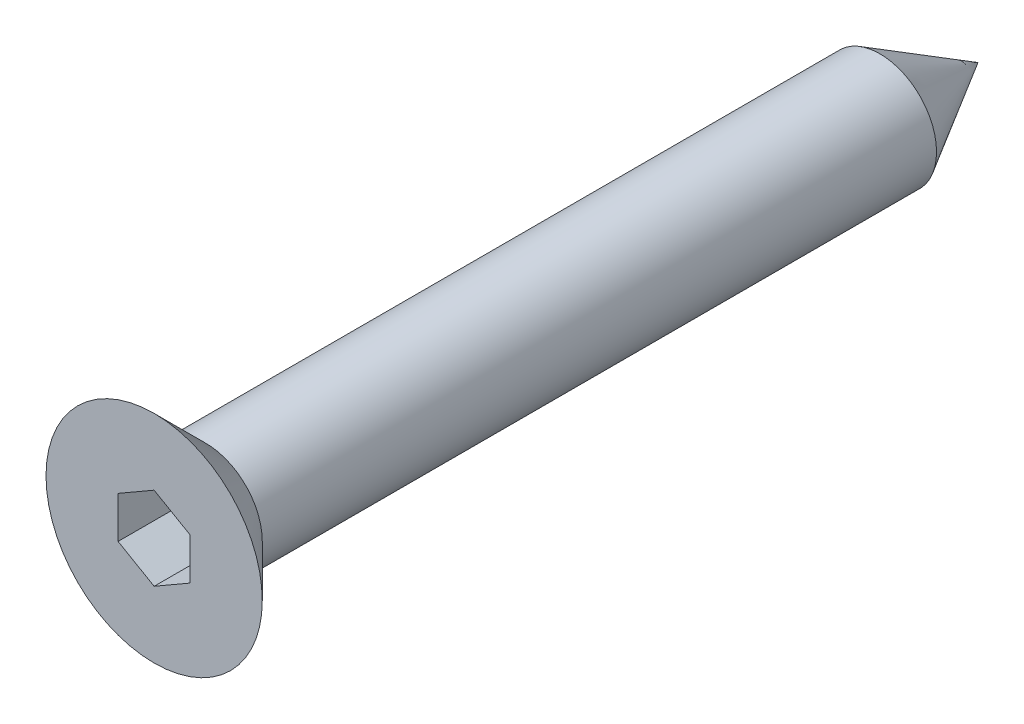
from build123d import *

# Parameters (mm, degrees)
ESQUISSE3_R             = 1.1
EXTRUSION1_DEPTH        = 16
ENL_V_MAT_EXTRU_2_DEPTH = 1.5
CHANFREIN1_SIZE         = 1.1
CHANFREIN1_SIZE2        = 1.905255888


with BuildPart() as part:
    # Esquisse1 → R_volution2 (revolve)
    with BuildSketch(Plane(origin=(0, 0, 0), x_dir=(0, 0, -1), z_dir=(1, 0, 0)), mode=Mode.PRIVATE) as r_volution2_sk:
        Polygon((0, 2.1), (1, 1.1), (1, 0), (0, 0), align=None)
    revolve(r_volution2_sk.sketch.rotate(Axis((0, 0, 1.603508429), (0, 0, -1)), 90), axis=Axis((0, 0, 1.603508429), (0, 0, -1)))

    # Esquisse3 → Extrusion1 (add)
    with BuildSketch(Plane.XY):
        Circle(ESQUISSE3_R)
    extrude(amount=-EXTRUSION1_DEPTH)

    # Esquisse2 → Enl_v. mat.-Extru.2 (cut)
    with BuildSketch(Plane.XY):
        Polygon((0, 0.808290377), (-0.7, 0.404145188), (-0.7, -0.404145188), (0, -0.808290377), (0.7, -0.404145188), (0.7, 0.404145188), align=None)
    extrude(amount=-ENL_V_MAT_EXTRU_2_DEPTH, mode=Mode.SUBTRACT)

    # Chanfrein1
    chanfrein1_edges = [part.edges().sort_by_distance(p)[0] for p in [
        (-1.1, 0, -16),
    ]]
    chanfrein1_side = [part.faces().sort_by_distance(p)[0] for p in [
        (0, 0, -16),
    ]]
    chamfer(chanfrein1_edges, length=CHANFREIN1_SIZE, length2=CHANFREIN1_SIZE2, reference=chanfrein1_side[0])


solid = part.part
